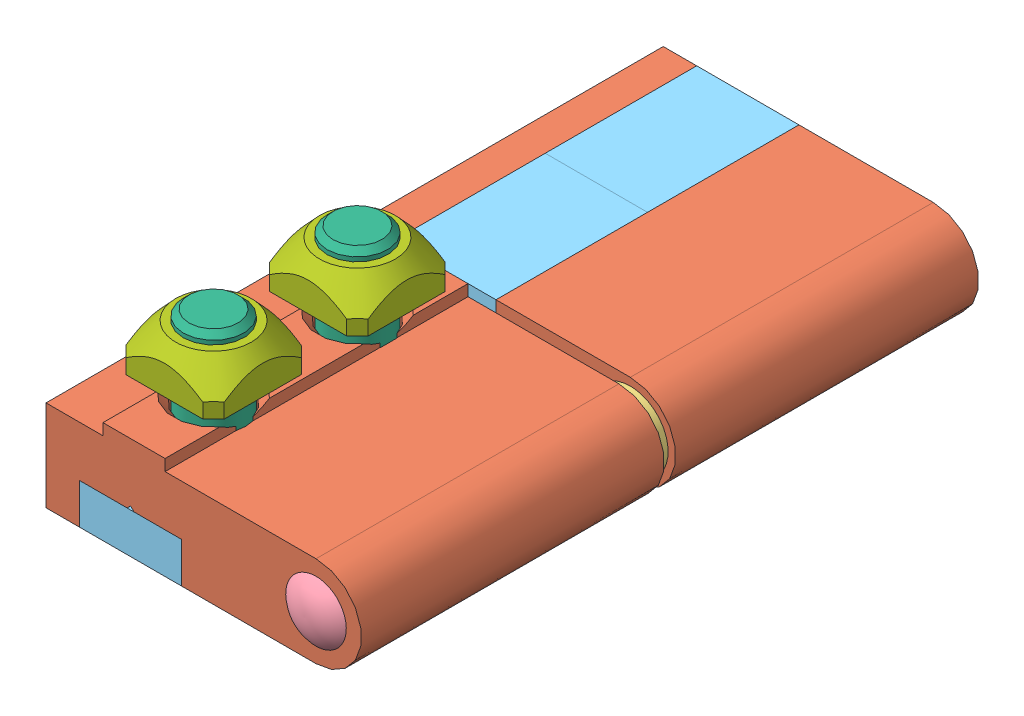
SolidWorks assembly 21.1096 HINGE 45 RIGHT HAND.SLDASM, configuration Default (file format 3800). Lengths in mm.
Overall size (42.18 34.64 84.51).
18 component instances, 7 part files, 38 mates.
Components (placement in the parent):
- 21.1096 HINGE PIN-1: 21.1096 HINGE PIN.SLDPRT [Default] at origin size (6.07 6.07 65)
- 21.1096 HINGE 45 AL BLOCK-1: 21.1096 HINGE 45 AL BLOCK.SLDPRT [Default] at (-24.5 -6 -8.25) x (-1 0 0) z (0 0 -1) size (41.65 13.5 40)
- 21.1096 HINGE WASHER-1: 21.1096 HINGE WASHER.SLDPRT [Default] at (0 0 33.25) x (-0.923728 -0.383049 0) z (0 0 -1) size (10 10 1.5)
- 21.1096 HINGE 45 AL BLOCK-2: 21.1096 HINGE 45 AL BLOCK.SLDPRT [Default] at (-24.5 6 73.25) x (-1 0 0) z (0 0 1) size (41.65 13.5 40)
- 21.1096 HINGE PIN END CAP-1: 21.1096 HINGE PIN END CAP.SLDPRT [Default] at (0 0 74.75) x (0.876397 0.48159 0) z (0.48159 -0.876397 0) size (8 7 8)
- 21.1096 HINGE PIN END CAP-2: 21.1096 HINGE PIN END CAP.SLDPRT [Default] at (0 0 -9.75) x (1 0 0) z (0 1 0) size (8 7 8)
- 22.1050 HINGE SCREW CAP-1: 22.1050 HINGE SCREW CAP.SLDPRT [Default] at (-31.2316 -6 63.25) x (0 0 1) z (1 0 0) size (20 5.34 13.5)
- 22.1050 HINGE SCREW CAP-2: 22.1050 HINGE SCREW CAP.SLDPRT [Default] at (-31.2316 -6 43.25) x (0 0 1) z (1 0 0) size (20 5.34 13.5)
- 22.1050 HINGE SCREW CAP-3: 22.1050 HINGE SCREW CAP.SLDPRT [Default] at (-31.2316 6 1.75) x (0 0 -1) z (1 0 0) size (20 5.34 13.5)
- 22.1050 HINGE SCREW CAP-4: 22.1050 HINGE SCREW CAP.SLDPRT [Default] at (-17.7316 6 21.75) x (0 0 1) z (-1 0 0) size (20 5.34 13.5)
- 21.1268 M8X18-1: 21.1268 M8X18.SLDPRT [Default] at (-24.0292 0.6971 21.25) x (0 -1 0) z (0 0 1) size (23 13 13)
- 21.1268 M8X18-2: 21.1268 M8X18.SLDPRT [Default] at (-24.0292 0.6971 2.25) x (0 -1 0) z (0 0 1) size (23 13 13)
- 21.1268 M8X18-3: 21.1268 M8X18.SLDPRT [Default] at (-24.0292 -0.6603 43.75) x (0 1 0) z (0 0 1) size (23 13 13)
- 21.1268 M8X18-4: 21.1268 M8X18.SLDPRT [Default] at (-24.0292 -0.6971 62.75) x (0 1 0) z (0 0 1) size (23 13 13)
- 21.1351 M8 SQUARE NUT-1: 21.1351 M8 SQUARE NUT.SLDPRT [Default] at (-24.0292 -10.5 21.25) x (1 0 0) z (0 1 0) size (13 13 5.5)
- 21.1351 M8 SQUARE NUT-2: 21.1351 M8 SQUARE NUT.SLDPRT [Default] at (-24.0292 10.5 43.75) x (1 0 0) z (0 -1 0) size (13 13 5.5)
- 21.1351 M8 SQUARE NUT-3: 21.1351 M8 SQUARE NUT.SLDPRT [Default] at (-24.0292 10.5 62.75) x (1 0 0) z (0 -1 0) size (13 13 5.5)
- 21.1351 M8 SQUARE NUT-4: 21.1351 M8 SQUARE NUT.SLDPRT [Default] at (-24.0292 -10.5 2.25) x (1 0 0) z (0 1 0) size (13 13 5.5)
Mates (geometry in assembly coordinates):
- Coincident1: coincident aligned: axis of 21.1096 HINGE 45 AL BLOCK-1; axis of 21.1096 HINGE PIN-1
- Distance1: distance = 33.25 mm aligned: plane of 21.1096 HINGE 45 AL BLOCK-1 through (-17.0063 -0.593 31.75) normal (0 0 1); plane of 21.1096 HINGE PIN-1 through (0 0 65) normal (0 0 1)
- Coincident3: coincident anti-aligned: axis of 21.1096 HINGE PIN-1; axis of 21.1096 HINGE 45 AL BLOCK-2
- Coincident4: coincident anti-aligned: plane of 21.1096 HINGE WASHER-1 through (0 0 31.75) normal (0 0 -1); plane of 21.1096 HINGE 45 AL BLOCK-1 through (-17.0063 -0.593 31.75) normal (0 0 1)
- Coincident5: coincident anti-aligned: axis of 21.1096 HINGE PIN-1; axis of 21.1096 HINGE WASHER-1
- Coincident6: coincident anti-aligned: plane of 21.1096 HINGE WASHER-1 through (0 0 33.25) normal (0 0 1); plane of 21.1096 HINGE 45 AL BLOCK-2 through (-17.0063 0.593 33.25) normal (0 0 -1)
- Coincident7: coincident anti-aligned: axis of 21.1096 HINGE 45 AL BLOCK-2; axis of 21.1096 HINGE PIN END CAP-1
- Coincident8: coincident anti-aligned: plane of 21.1096 HINGE 45 AL BLOCK-2 through (-17.0063 0.593 73.25) normal (0 0 1); plane of 21.1096 HINGE PIN END CAP-1 through (3.1112 1.7096 73.25) normal (0 0 -1)
- Coincident9: coincident anti-aligned: axis of 21.1096 HINGE 45 AL BLOCK-1; axis of 21.1096 HINGE PIN END CAP-2
- Coincident10: coincident anti-aligned: plane of 21.1096 HINGE 45 AL BLOCK-1 through (-17.0063 -0.593 -8.25) normal (0 0 -1); plane of 21.1096 HINGE PIN END CAP-2 through (3.55 0 -8.25) normal (0 0 1)
- Coincident11: coincident aligned: plane of 22.1050 HINGE SCREW CAP-1 through (-31.2316 -6 73.25) normal (0 0 1); plane of 21.1096 HINGE 45 AL BLOCK-2 through (-17.0063 0.593 73.25) normal (0 0 1)
- Coincident12: coincident aligned: plane of 21.1096 HINGE 45 AL BLOCK-2 through (-17.7316 -6 73.25) normal (0 -1 0); plane of 22.1050 HINGE SCREW CAP-1 through (-31.2316 -6 53.25) normal (0 -1 0)
- Coincident13: coincident anti-aligned: plane of 21.1096 HINGE 45 AL BLOCK-2 through (-17.7316 -0.6603 73.25) normal (-1 0 0); plane of 22.1050 HINGE SCREW CAP-1 through (-17.7316 -4.4369 63.25) normal (1 0 0)
- Coincident14: coincident anti-aligned: plane of 22.1050 HINGE SCREW CAP-1 through (-31.2316 -0.66 53.25) normal (0 0 -1); plane of 22.1050 HINGE SCREW CAP-2 through (-31.2316 -6 53.25) normal (0 0 1)
- Coincident15: coincident aligned: plane of 21.1096 HINGE 45 AL BLOCK-2 through (-17.7316 -6 73.25) normal (0 -1 0); plane of 22.1050 HINGE SCREW CAP-2 through (-31.2316 -6 33.25) normal (0 -1 0)
- Coincident16: coincident anti-aligned: plane of 21.1096 HINGE 45 AL BLOCK-2 through (-17.7316 -0.6603 73.25) normal (-1 0 0); plane of 22.1050 HINGE SCREW CAP-2 through (-17.7316 -4.4369 43.25) normal (1 0 0)
- Coincident17: coincident aligned: plane of 22.1050 HINGE SCREW CAP-3 through (-31.2316 6 -8.25) normal (0 0 -1); plane of 21.1096 HINGE 45 AL BLOCK-1 through (-17.0063 -0.593 -8.25) normal (0 0 -1)
- Coincident18: coincident aligned: plane of 21.1096 HINGE 45 AL BLOCK-1 through (-17.7316 6 -8.25) normal (0 1 0); plane of 22.1050 HINGE SCREW CAP-3 through (-31.2316 6 11.75) normal (0 1 0)
- Coincident19: coincident anti-aligned: plane of 21.1096 HINGE 45 AL BLOCK-1 through (-17.7316 0.6603 -8.25) normal (-1 0 0); plane of 22.1050 HINGE SCREW CAP-3 through (-17.7316 4.4369 1.75) normal (1 0 0)
- Coincident20: coincident anti-aligned: plane of 22.1050 HINGE SCREW CAP-3 through (-31.2316 0.66 11.75) normal (0 0 1); plane of 22.1050 HINGE SCREW CAP-4 through (-17.7316 0.66 11.75) normal (0 0 -1)
- Coincident21: coincident anti-aligned: plane of 21.1096 HINGE 45 AL BLOCK-1 through (-31.2316 6 -8.25) normal (1 0 0); plane of 22.1050 HINGE SCREW CAP-4 through (-31.2316 4.4369 21.75) normal (-1 0 0)
- Coincident22: coincident aligned: plane of 21.1096 HINGE 45 AL BLOCK-1 through (-17.7316 6 -8.25) normal (0 1 0); plane of 22.1050 HINGE SCREW CAP-4 through (-17.7316 6 11.75) normal (0 1 0)
- Coincident23: coincident anti-aligned: axis of 21.1096 HINGE 45 AL BLOCK-2; axis of 21.1268 M8X18-4
- Coincident24: coincident anti-aligned: axis of 21.1096 HINGE 45 AL BLOCK-2; axis of 21.1268 M8X18-3
- Coincident25: coincident anti-aligned: plane of 21.1096 HINGE 45 AL BLOCK-2 through (-31.2316 -0.6971 73.25) normal (0 -1 0); plane of 21.1268 M8X18-4 through (-29.2792 -0.6971 62.75) normal (0 1 0)
- Coincident26: coincident anti-aligned: plane of 21.1096 HINGE 45 AL BLOCK-2 through (-24 -0.6603 73.25) normal (0 -1 0); plane of 21.1268 M8X18-3 through (-29.2792 -0.6603 43.75) normal (0 1 0)
- Coincident27: coincident anti-aligned: axis of 21.1096 HINGE 45 AL BLOCK-1; axis of 21.1268 M8X18-1
- Coincident28: coincident anti-aligned: plane of 21.1096 HINGE 45 AL BLOCK-1 through (-31.2316 0.6971 -8.25) normal (0 1 0); plane of 21.1268 M8X18-1 through (-18.7792 0.6971 21.25) normal (0 -1 0)
- Coincident29: coincident anti-aligned: axis of 21.1096 HINGE 45 AL BLOCK-1; axis of 21.1268 M8X18-2
- Coincident30: coincident anti-aligned: plane of 21.1096 HINGE 45 AL BLOCK-1 through (-31.2316 0.6971 -8.25) normal (0 1 0); plane of 21.1268 M8X18-2 through (-18.7792 0.6971 2.25) normal (0 -1 0)
- Coincident31: coincident aligned: axis of 21.1351 M8 SQUARE NUT-3; axis of 21.1268 M8X18-4
- Distance2: distance = 4.5 mm anti-aligned: plane of 21.1096 HINGE 45 AL BLOCK-2 through (0 6 73.25) normal (0 1 0); plane of 21.1351 M8 SQUARE NUT-3 through (-24.0292 10.5 62.75) normal (0 -1 0)
- Coincident33: coincident aligned: axis of 21.1351 M8 SQUARE NUT-2; axis of 21.1268 M8X18-3
- Distance3: distance = 4.5 mm anti-aligned: plane of 21.1351 M8 SQUARE NUT-2 through (-24.0292 10.5 43.75) normal (0 -1 0); plane of 21.1096 HINGE 45 AL BLOCK-2 through (0 6 73.25) normal (0 1 0)
- Coincident35: coincident aligned: axis of 21.1268 M8X18-1; axis of 21.1351 M8 SQUARE NUT-1
- Distance4: distance = 4.5 mm anti-aligned: plane of 21.1351 M8 SQUARE NUT-1 through (-24.0292 -10.5 21.25) normal (0 1 0); plane of 21.1096 HINGE 45 AL BLOCK-1 through (0 -6 -8.25) normal (0 -1 0)
- Coincident37: coincident aligned: axis of 21.1268 M8X18-2; axis of ?
- Distance5: distance = 4.5 mm anti-aligned: plane of 21.1096 HINGE 45 AL BLOCK-1 through (0 -6 -8.25) normal (0 -1 0); plane of 21.1351 M8 SQUARE NUT-4 through (-24.0292 -10.5 2.25) normal (0 1 0)
